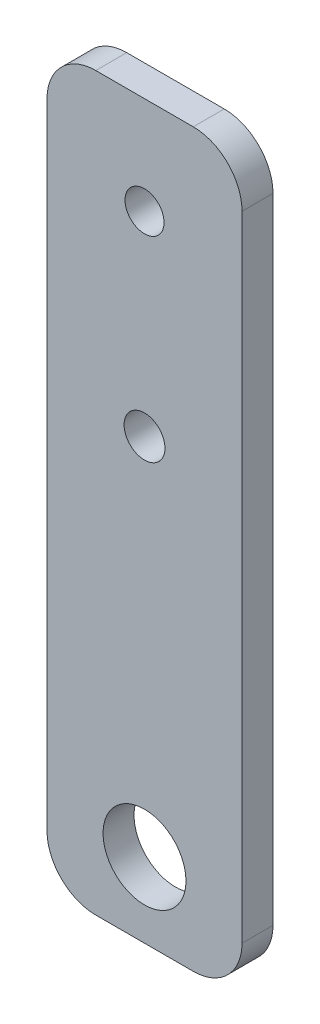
from build123d import *

# Parameters (mm, degrees)
SKETCH1_W           = 20
SKETCH1_H           = 20
SKETCH1_R           = 2
SKETCH1_R_2         = 2.095
SKETCH1_H_2         = 35
SKETCH1_R_3         = 4.25
BOSS_EXTRUDE1_DEPTH = 3.175
FILLET1_R           = 5


with BuildPart() as part:
    # Sketch1 → Boss-Extrude1 (new body)
    # profile 1 of 3: a face of its own
    with BuildSketch(Plane.XY):
        with Locations((0, 10)):
            Rectangle(SKETCH1_W, SKETCH1_H)
        with Locations((0, 10)):
            Circle(SKETCH1_R, mode=Mode.SUBTRACT)
    # profile 2 of 3: a face of its own
    with BuildSketch(Plane.XY):
        with Locations((0, -10)):
            Rectangle(SKETCH1_W, SKETCH1_H)
        with Locations((0, -10)):
            Circle(SKETCH1_R_2, mode=Mode.SUBTRACT)
    # profile 3 of 3: a face of its own
    with BuildSketch(Plane.XY):
        with Locations((0, -37.5)):
            Rectangle(SKETCH1_W, SKETCH1_H_2)
        with Locations((0, -47.35)):
            Circle(SKETCH1_R_3, mode=Mode.SUBTRACT)
    extrude(amount=BOSS_EXTRUDE1_DEPTH)

    # Fillet1
    fillet1_edges = [part.edges().sort_by_distance(p)[0] for p in [
        (-10, 20, 1.5875),
        (10, 20, 1.5875),
        (10, -55, 1.5875),
        (-10, -55, 1.5875),
    ]]
    fillet(fillet1_edges, radius=FILLET1_R)


solid = part.part
